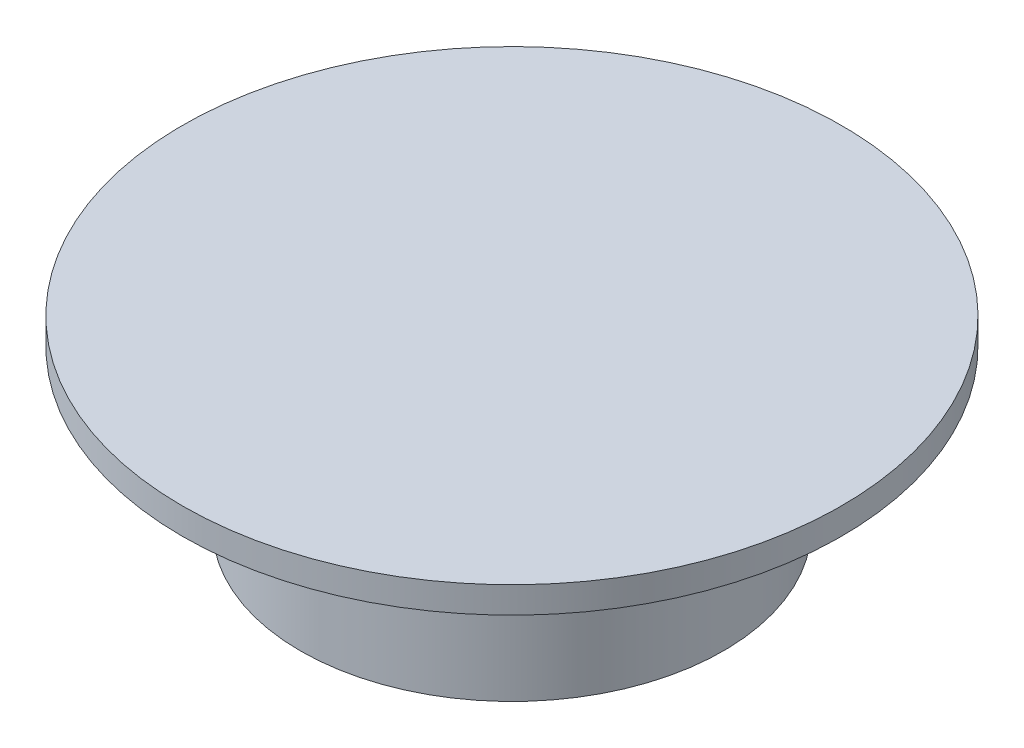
ISO-10303-21;
HEADER;
FILE_DESCRIPTION(('STEP AP214'),'2;1');
FILE_NAME('part.step','',(''),(''),'','','');
FILE_SCHEMA(('AUTOMOTIVE_DESIGN { 1 0 10303 214 1 1 1 1 }'));
ENDSEC;
DATA;
#1=APPLICATION_CONTEXT('core data for automotive mechanical design processes');
#2=APPLICATION_PROTOCOL_DEFINITION('international standard','automotive_design',2000,#1);
#3=PRODUCT_CONTEXT('',#1,'mechanical');
#4=PRODUCT('Part','Part','',(#3));
#5=PRODUCT_RELATED_PRODUCT_CATEGORY('part','',(#4));
#6=PRODUCT_DEFINITION_FORMATION('','',#4);
#7=PRODUCT_DEFINITION_CONTEXT('part definition',#1,'design');
#8=PRODUCT_DEFINITION('design','',#6,#7);
#9=PRODUCT_DEFINITION_SHAPE('','',#8);
#10=(LENGTH_UNIT() NAMED_UNIT(*) SI_UNIT(.MILLI.,.METRE.));
#11=(NAMED_UNIT(*) PLANE_ANGLE_UNIT() SI_UNIT($,.RADIAN.));
#12=(NAMED_UNIT(*) SI_UNIT($,.STERADIAN.) SOLID_ANGLE_UNIT());
#13=UNCERTAINTY_MEASURE_WITH_UNIT(LENGTH_MEASURE(1.E-05),#10,'distance_accuracy_value','');
#14=(GEOMETRIC_REPRESENTATION_CONTEXT(3) GLOBAL_UNCERTAINTY_ASSIGNED_CONTEXT((#13)) GLOBAL_UNIT_ASSIGNED_CONTEXT((#10,
#11,#12)) REPRESENTATION_CONTEXT('',''));
#15=CARTESIAN_POINT('',(0.,0.,0.));
#16=DIRECTION('',(0.,0.,1.));
#17=DIRECTION('',(1.,0.,0.));
#18=AXIS2_PLACEMENT_3D('',#15,#16,#17);
#19=CARTESIAN_POINT('',(0.,7.,0.));
#20=DIRECTION('',(0.,-1.,0.));
#21=DIRECTION('',(0.,0.,-1.));
#22=AXIS2_PLACEMENT_3D('',#19,#20,#21);
#23=PLANE('',#22);
#24=CARTESIAN_POINT('',(0.,7.,0.));
#25=DIRECTION('',(0.,1.,0.));
#26=DIRECTION('',(0.,0.,1.));
#27=AXIS2_PLACEMENT_3D('',#24,#25,#26);
#28=CIRCLE('',#27,25.);
#29=CARTESIAN_POINT('',(0.,7.,25.));
#30=VERTEX_POINT('',#29);
#31=EDGE_CURVE('E10',#30,#30,#28,.T.);
#32=ORIENTED_EDGE('',*,*,#31,.T.);
#33=EDGE_LOOP('',(#32));
#34=FACE_BOUND('',#33,.T.);
#35=ADVANCED_FACE('F31',(#34),#23,.F.);
#36=CARTESIAN_POINT('',(0.,7.00000000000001,0.));
#37=DIRECTION('',(0.,1.,0.));
#38=DIRECTION('',(0.,0.,1.));
#39=AXIS2_PLACEMENT_3D('',#36,#37,#38);
#40=CYLINDRICAL_SURFACE('',#39,25.);
#41=ORIENTED_EDGE('',*,*,#31,.F.);
#42=EDGE_LOOP('',(#41));
#43=FACE_BOUND('',#42,.T.);
#44=CARTESIAN_POINT('',(0.,5.,0.));
#45=DIRECTION('',(0.,1.,0.));
#46=DIRECTION('',(0.,0.,1.));
#47=AXIS2_PLACEMENT_3D('',#44,#45,#46);
#48=CIRCLE('',#47,25.);
#49=CARTESIAN_POINT('',(0.,5.,25.));
#50=VERTEX_POINT('',#49);
#51=EDGE_CURVE('E37',#50,#50,#48,.T.);
#52=ORIENTED_EDGE('',*,*,#51,.T.);
#53=EDGE_LOOP('',(#52));
#54=FACE_BOUND('',#53,.T.);
#55=ADVANCED_FACE('F63',(#43,#54),#40,.T.);
#56=CARTESIAN_POINT('',(0.,2.,0.));
#57=DIRECTION('',(0.,1.,0.));
#58=DIRECTION('',(0.,0.,1.));
#59=AXIS2_PLACEMENT_3D('',#56,#57,#58);
#60=CONICAL_SURFACE('',#59,16.05,1.2473707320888);
#61=ORIENTED_EDGE('',*,*,#51,.F.);
#62=EDGE_LOOP('',(#61));
#63=FACE_BOUND('',#62,.T.);
#64=CARTESIAN_POINT('',(0.,2.,0.));
#65=DIRECTION('',(0.,1.,0.));
#66=DIRECTION('',(0.,0.,1.));
#67=AXIS2_PLACEMENT_3D('',#64,#65,#66);
#68=CIRCLE('',#67,16.05);
#69=CARTESIAN_POINT('',(0.,2.,16.05));
#70=VERTEX_POINT('',#69);
#71=EDGE_CURVE('E41',#70,#70,#68,.T.);
#72=ORIENTED_EDGE('',*,*,#71,.T.);
#73=EDGE_LOOP('',(#72));
#74=FACE_BOUND('',#73,.T.);
#75=ADVANCED_FACE('F59',(#63,#74),#60,.T.);
#76=CARTESIAN_POINT('',(0.,7.00000000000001,0.));
#77=DIRECTION('',(0.,1.,0.));
#78=DIRECTION('',(0.,0.,1.));
#79=AXIS2_PLACEMENT_3D('',#76,#77,#78);
#80=CYLINDRICAL_SURFACE('',#79,16.05);
#81=ORIENTED_EDGE('',*,*,#71,.F.);
#82=EDGE_LOOP('',(#81));
#83=FACE_BOUND('',#82,.T.);
#84=CARTESIAN_POINT('',(0.,-7.,0.));
#85=DIRECTION('',(0.,1.,0.));
#86=DIRECTION('',(0.,0.,1.));
#87=AXIS2_PLACEMENT_3D('',#84,#85,#86);
#88=CIRCLE('',#87,16.05);
#89=CARTESIAN_POINT('',(0.,-7.,16.05));
#90=VERTEX_POINT('',#89);
#91=EDGE_CURVE('E45',#90,#90,#88,.T.);
#92=ORIENTED_EDGE('',*,*,#91,.T.);
#93=EDGE_LOOP('',(#92));
#94=FACE_BOUND('',#93,.T.);
#95=ADVANCED_FACE('F51',(#83,#94),#80,.T.);
#96=CARTESIAN_POINT('',(16.05,-7.,0.));
#97=DIRECTION('',(0.,1.,0.));
#98=DIRECTION('',(0.,0.,1.));
#99=AXIS2_PLACEMENT_3D('',#96,#97,#98);
#100=PLANE('',#99);
#101=ORIENTED_EDGE('',*,*,#91,.F.);
#102=EDGE_LOOP('',(#101));
#103=FACE_BOUND('',#102,.T.);
#104=ADVANCED_FACE('F53',(#103),#100,.F.);
#105=CLOSED_SHELL('',(#35,#55,#75,#95,#104));
#106=MANIFOLD_SOLID_BREP('B2',#105);
#107=ADVANCED_BREP_SHAPE_REPRESENTATION('',(#18,#106),#14);
#108=SHAPE_DEFINITION_REPRESENTATION(#9,#107);
ENDSEC;
END-ISO-10303-21;
